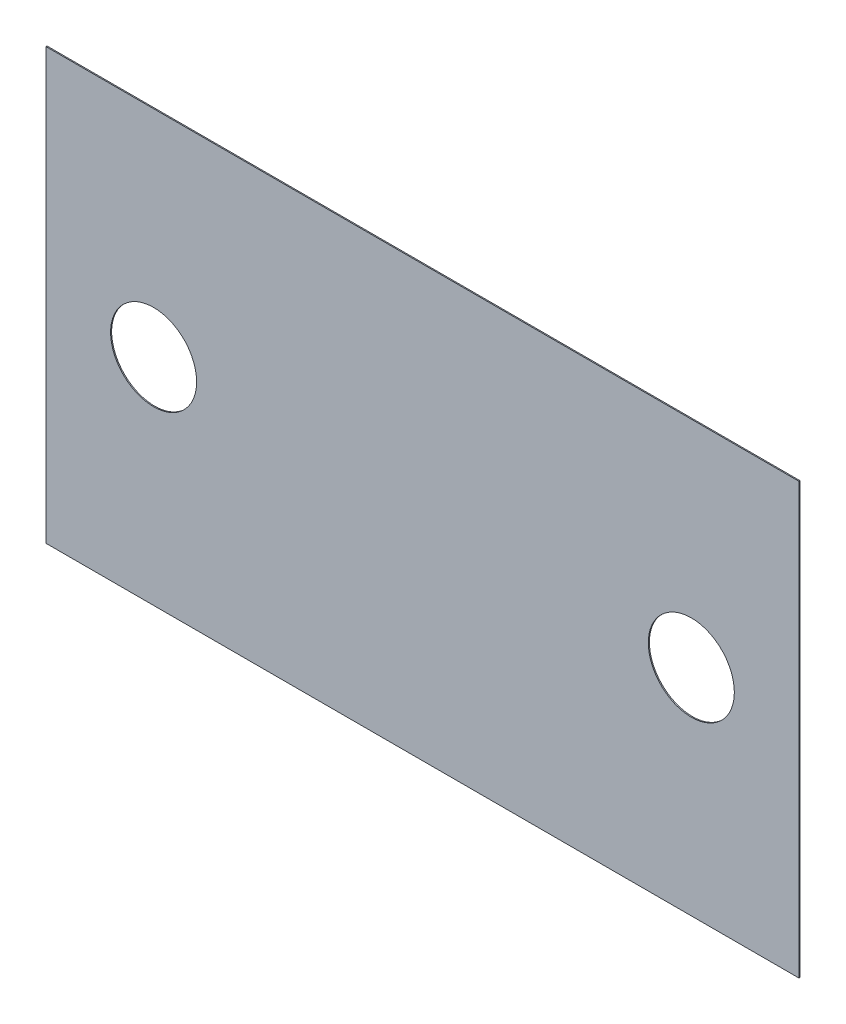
from build123d import *

# Parameters (mm, degrees)
CROQUIS1_W     = 70
CROQUIS1_H     = 40
CROQUIS1_R     = 4
EXTRUIR1_DEPTH = 0.1


with BuildPart() as part:
    # Croquis1 → Extruir1 (new body)
    with BuildSketch(Plane.XY):
        Rectangle(CROQUIS1_W, CROQUIS1_H)
        with Locations((-25, 0)):
            Circle(CROQUIS1_R, mode=Mode.SUBTRACT)
        with Locations((25, 0)):
            Circle(CROQUIS1_R, mode=Mode.SUBTRACT)
    extrude(amount=EXTRUIR1_DEPTH)


solid = part.part
